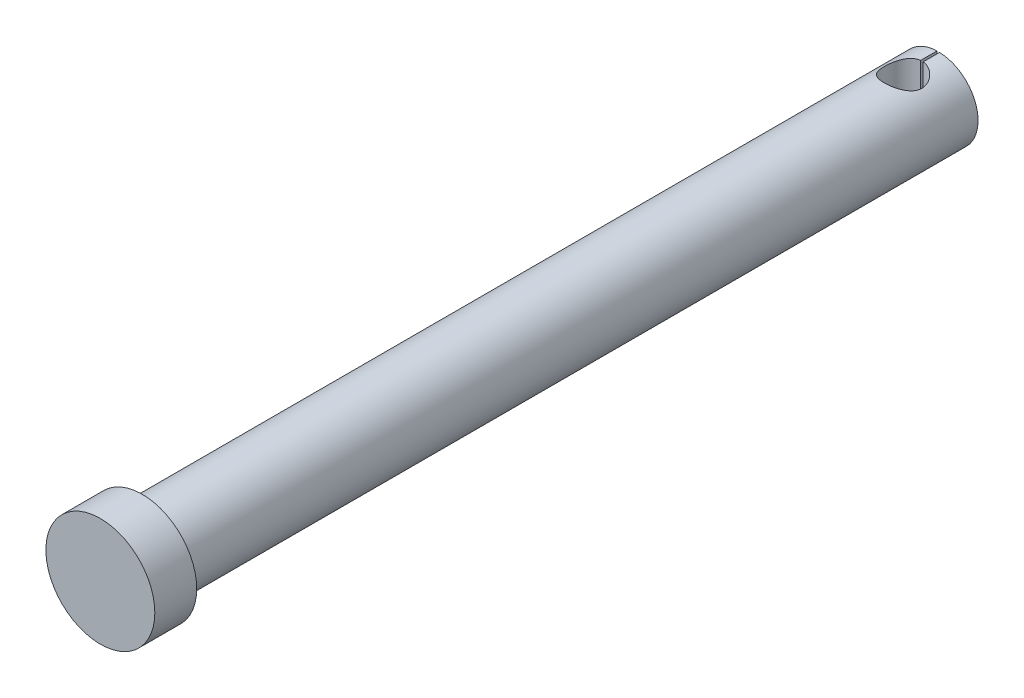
from build123d import *

# Parameters (mm, degrees)
ESQUISSE1_R             = 4.75
BOSS_EXTRU_1_DEPTH      = 100
ESQUISSE3_R             = 6.5
BOSS_EXTRU_2_DEPTH      = 5
CONG_1_R                = 0.5
ESQUISSE2_R             = 2.25
ENL_V_MAT_EXTRU_1_DEPTH = 50
ESQUISSE4_W             = 0.3
ESQUISSE4_H             = 5
ENL_V_MAT_EXTRU_2_DEPTH = 7.5


with BuildPart() as part:
    # Esquisse1 → Boss.-Extru.1 (new body)
    with BuildSketch(Plane.XY):
        Circle(ESQUISSE1_R)
    extrude(amount=BOSS_EXTRU_1_DEPTH)

    # Esquisse3 → Boss.-Extru.2 (add)
    with BuildSketch(Plane.XY.offset(100)):
        Circle(ESQUISSE3_R)
    extrude(amount=-BOSS_EXTRU_2_DEPTH)

    # Cong_1
    cong_1_edges = [part.edges().sort_by_distance(p)[0] for p in [
        (-4.75, 0, 95),
    ]]
    fillet(cong_1_edges, radius=CONG_1_R)

    # Esquisse2 → Enl_v. mat.-Extru.1 (cut, symmetric)
    with BuildSketch(Plane(origin=(0, 0, 0), x_dir=(1, 0, 0), z_dir=(0, 1, 0))):
        with Locations(Location((0, -4.2, 0), (0, 0, 270))):
            Circle(ESQUISSE2_R)
    extrude(amount=ENL_V_MAT_EXTRU_1_DEPTH, both=True, mode=Mode.SUBTRACT)

    # Esquisse4 → Enl_v. mat.-Extru.2 (cut, symmetric)
    with BuildSketch(Plane(origin=(0, 0, 0), x_dir=(1, 0, 0), z_dir=(0, 1, 0))):
        with Locations((0, -1.5)):
            Rectangle(ESQUISSE4_W, ESQUISSE4_H)
    extrude(amount=ENL_V_MAT_EXTRU_2_DEPTH, both=True, mode=Mode.SUBTRACT)


solid = part.part
